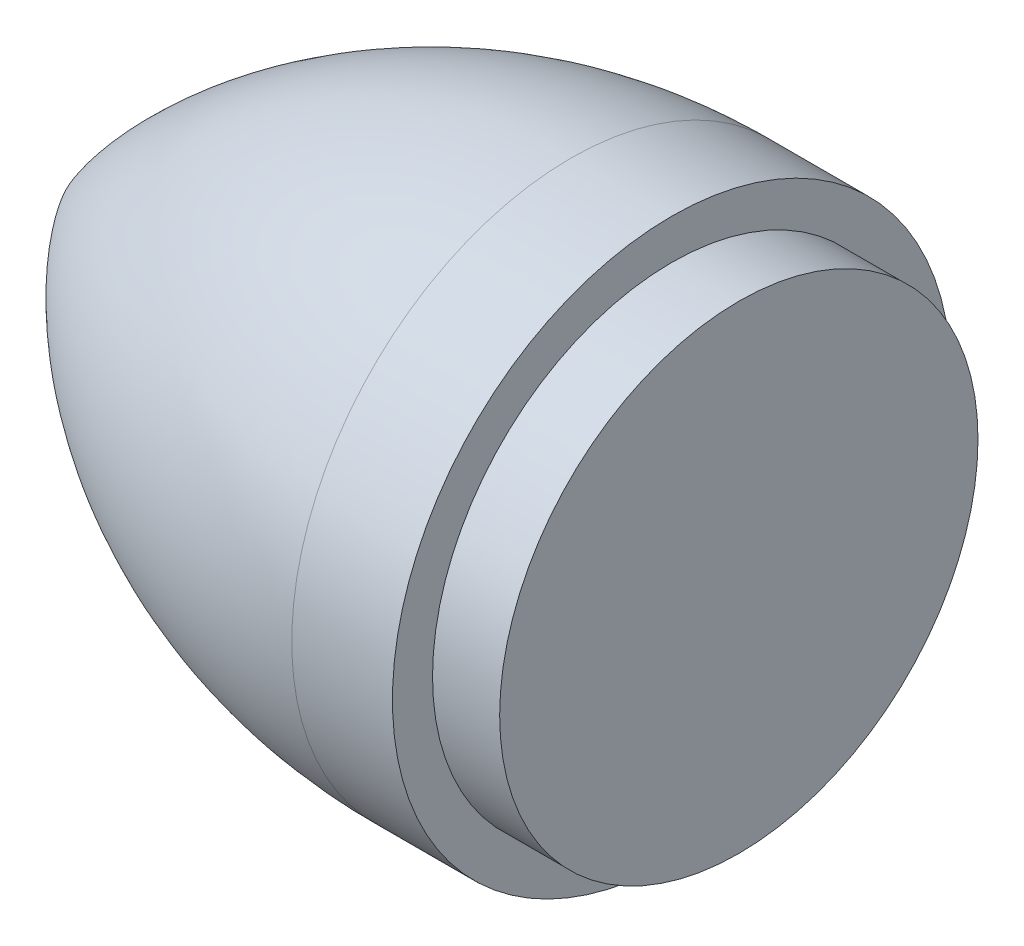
ISO-10303-21;
HEADER;
FILE_DESCRIPTION(('STEP AP214'),'2;1');
FILE_NAME('part.step','',(''),(''),'','','');
FILE_SCHEMA(('AUTOMOTIVE_DESIGN { 1 0 10303 214 1 1 1 1 }'));
ENDSEC;
DATA;
#1=APPLICATION_CONTEXT('core data for automotive mechanical design processes');
#2=APPLICATION_PROTOCOL_DEFINITION('international standard','automotive_design',2000,#1);
#3=PRODUCT_CONTEXT('',#1,'mechanical');
#4=PRODUCT('Part','Part','',(#3));
#5=PRODUCT_RELATED_PRODUCT_CATEGORY('part','',(#4));
#6=PRODUCT_DEFINITION_FORMATION('','',#4);
#7=PRODUCT_DEFINITION_CONTEXT('part definition',#1,'design');
#8=PRODUCT_DEFINITION('design','',#6,#7);
#9=PRODUCT_DEFINITION_SHAPE('','',#8);
#10=(LENGTH_UNIT() NAMED_UNIT(*) SI_UNIT(.MILLI.,.METRE.));
#11=(NAMED_UNIT(*) PLANE_ANGLE_UNIT() SI_UNIT($,.RADIAN.));
#12=(NAMED_UNIT(*) SI_UNIT($,.STERADIAN.) SOLID_ANGLE_UNIT());
#13=UNCERTAINTY_MEASURE_WITH_UNIT(LENGTH_MEASURE(1.E-05),#10,'distance_accuracy_value','');
#14=(GEOMETRIC_REPRESENTATION_CONTEXT(3) GLOBAL_UNCERTAINTY_ASSIGNED_CONTEXT((#13)) GLOBAL_UNIT_ASSIGNED_CONTEXT((#10,
#11,#12)) REPRESENTATION_CONTEXT('',''));
#15=CARTESIAN_POINT('',(0.,0.,0.));
#16=DIRECTION('',(0.,0.,1.));
#17=DIRECTION('',(1.,0.,0.));
#18=AXIS2_PLACEMENT_3D('',#15,#16,#17);
#19=CARTESIAN_POINT('',(0.,71.25,0.));
#20=DIRECTION('',(1.,0.,0.));
#21=DIRECTION('',(0.,1.,0.));
#22=AXIS2_PLACEMENT_3D('',#19,#20,#21);
#23=PLANE('',#22);
#24=CARTESIAN_POINT('',(0.,0.,0.));
#25=DIRECTION('',(1.,0.,0.));
#26=DIRECTION('',(0.,1.,0.));
#27=AXIS2_PLACEMENT_3D('',#24,#25,#26);
#28=CIRCLE('',#27,71.25);
#29=CARTESIAN_POINT('',(0.,71.25,0.));
#30=VERTEX_POINT('',#29);
#31=EDGE_CURVE('E11',#30,#30,#28,.T.);
#32=ORIENTED_EDGE('',*,*,#31,.T.);
#33=EDGE_LOOP('',(#32));
#34=FACE_BOUND('',#33,.T.);
#35=ADVANCED_FACE('F32',(#34),#23,.T.);
#36=CARTESIAN_POINT('',(0.,0.,0.));
#37=DIRECTION('',(1.,0.,0.));
#38=DIRECTION('',(0.,1.,0.));
#39=AXIS2_PLACEMENT_3D('',#36,#37,#38);
#40=CYLINDRICAL_SURFACE('',#39,71.25);
#41=CARTESIAN_POINT('',(-20.,0.,0.));
#42=DIRECTION('',(1.,0.,0.));
#43=DIRECTION('',(0.,1.,0.));
#44=AXIS2_PLACEMENT_3D('',#41,#42,#43);
#45=CIRCLE('',#44,71.25);
#46=CARTESIAN_POINT('',(-20.,71.25,0.));
#47=VERTEX_POINT('',#46);
#48=EDGE_CURVE('E38',#47,#47,#45,.T.);
#49=ORIENTED_EDGE('',*,*,#48,.T.);
#50=EDGE_LOOP('',(#49));
#51=FACE_BOUND('',#50,.T.);
#52=ORIENTED_EDGE('',*,*,#31,.F.);
#53=EDGE_LOOP('',(#52));
#54=FACE_BOUND('',#53,.T.);
#55=ADVANCED_FACE('F57',(#51,#54),#40,.T.);
#56=CARTESIAN_POINT('',(-20.,71.25,0.));
#57=DIRECTION('',(1.,0.,0.));
#58=DIRECTION('',(0.,1.,0.));
#59=AXIS2_PLACEMENT_3D('',#56,#57,#58);
#60=PLANE('',#59);
#61=CARTESIAN_POINT('',(-20.,0.,0.));
#62=DIRECTION('',(1.,0.,0.));
#63=DIRECTION('',(0.,1.,0.));
#64=AXIS2_PLACEMENT_3D('',#61,#62,#63);
#65=CIRCLE('',#64,83.185);
#66=CARTESIAN_POINT('',(-20.,83.185,0.));
#67=VERTEX_POINT('',#66);
#68=EDGE_CURVE('E50',#67,#67,#65,.T.);
#69=ORIENTED_EDGE('',*,*,#68,.T.);
#70=EDGE_LOOP('',(#69));
#71=FACE_BOUND('',#70,.T.);
#72=ORIENTED_EDGE('',*,*,#48,.F.);
#73=EDGE_LOOP('',(#72));
#74=FACE_BOUND('',#73,.T.);
#75=ADVANCED_FACE('F60',(#71,#74),#60,.T.);
#76=CARTESIAN_POINT('',(0.,0.,0.));
#77=DIRECTION('',(1.,0.,0.));
#78=DIRECTION('',(0.,1.,0.));
#79=AXIS2_PLACEMENT_3D('',#76,#77,#78);
#80=CYLINDRICAL_SURFACE('',#79,83.185);
#81=CARTESIAN_POINT('',(-50.,0.,0.));
#82=DIRECTION('',(1.,0.,0.));
#83=DIRECTION('',(0.,1.,0.));
#84=AXIS2_PLACEMENT_3D('',#81,#82,#83);
#85=CIRCLE('',#84,83.1850000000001);
#86=CARTESIAN_POINT('',(-50.,83.1850000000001,0.));
#87=VERTEX_POINT('',#86);
#88=EDGE_CURVE('E48',#87,#87,#85,.T.);
#89=ORIENTED_EDGE('',*,*,#88,.T.);
#90=EDGE_LOOP('',(#89));
#91=FACE_BOUND('',#90,.T.);
#92=ORIENTED_EDGE('',*,*,#68,.F.);
#93=EDGE_LOOP('',(#92));
#94=FACE_BOUND('',#93,.T.);
#95=ADVANCED_FACE('F44',(#91,#94),#80,.T.);
#96=CARTESIAN_POINT('',(-50.0000000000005,-93.6482284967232,0.));
#97=DIRECTION('',(0.,0.,-1.));
#98=DIRECTION('',(0.,1.,0.));
#99=AXIS2_PLACEMENT_3D('',#96,#97,#98);
#100=CIRCLE('',#99,176.833228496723);
#101=TRIMMED_CURVE('',#100,(PARAMETER_VALUE(-1.01268505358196)),
(PARAMETER_VALUE(1.01268505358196)),.T.,.PARAMETER.);
#102=CARTESIAN_POINT('',(-50.0000000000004,0.,0.));
#103=DIRECTION('',(1.,0.,0.));
#104=AXIS1_PLACEMENT('',#102,#103);
#105=SURFACE_OF_REVOLUTION('',#101,#104);
#106=CARTESIAN_POINT('',(-200.,0.,0.));
#107=VERTEX_POINT('',#106);
#108=VERTEX_LOOP('',#107);
#109=FACE_BOUND('',#108,.T.);
#110=ORIENTED_EDGE('',*,*,#88,.F.);
#111=EDGE_LOOP('',(#110));
#112=FACE_BOUND('',#111,.T.);
#113=ADVANCED_FACE('F41',(#109,#112),#105,.T.);
#114=CLOSED_SHELL('',(#35,#55,#75,#95,#113));
#115=MANIFOLD_SOLID_BREP('B2',#114);
#116=ADVANCED_BREP_SHAPE_REPRESENTATION('',(#18,#115),#14);
#117=SHAPE_DEFINITION_REPRESENTATION(#9,#116);
ENDSEC;
END-ISO-10303-21;
